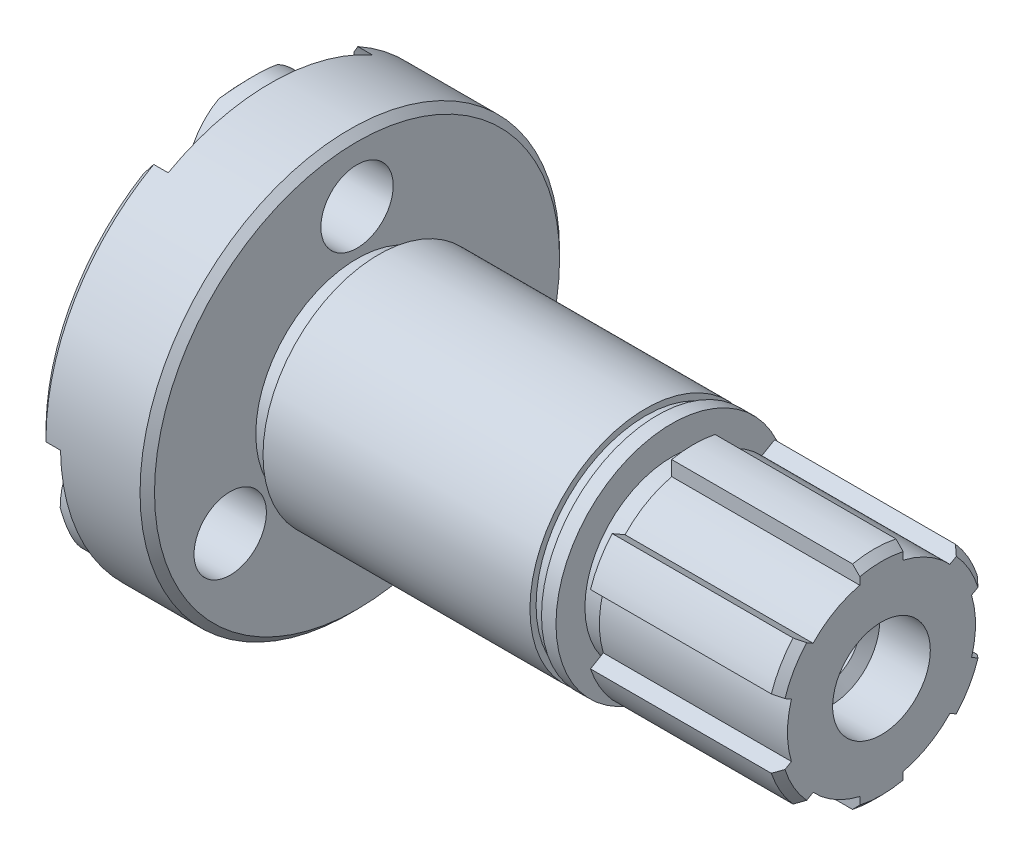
from build123d import *

# Parameters (mm, degrees)
CHANFREIN3_SIZE              = 1
ENL_V_MAT_EXTRU_1_REACH      = 98.635
ESQUISSE2_R                  = 5
ESQUISSE3_R                  = 15
ESQUISSE3_R_2                = 8.5
ENL_V_MAT_EXTRU_2_DEPTH      = 3
R_P_TITION_CIRCULAIRE1_COUNT = 3
ENL_V_MAT_EXTRU_3_REACH      = 98.635
R_P_TITION_CIRCULAIRE2_COUNT = 6
TROU_TARAUD_M12X1_751_D      = 10.2
TROU_TARAUD_M12X1_751_DEPTH  = 35
TROU_TARAUD_M12X1_751_TIP    = 3.064389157
D_GAGEMENT_POUR_M121_D       = 13.5
D_GAGEMENT_POUR_M121_DEPTH   = 7
D_GAGEMENT_POUR_M121_TIP     = 4.055809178


with BuildPart() as part:
    # Esquisse1 → Base-R_volution (revolve)
    with BuildSketch(Plane.XY, mode=Mode.PRIVATE) as base_r_volution_sk:
        Polygon((0, 0), (87.5, 0), (87.5, 15), (61.5, 15), (61.5, 12), (58.5, 12), (58.5, 16), (56.5, 16), (56.5, 15.15), (54.9, 15.15), (54.9, 16), (18, 16), (18, 14), (15, 14), (15, 29), (0, 29), align=None)
    revolve(base_r_volution_sk.sketch.rotate(Axis((0, 0, 0), (1, 0, 0)), 90), axis=Axis((0, 0, 0), (1, 0, 0)))

    # Chanfrein3
    chanfrein3_edges = [part.edges().sort_by_distance(p)[0] for p in [
        (15, 0, -29),
        (0, 0, -29),
        (87.5, 0, -15),
    ]]
    chamfer(chanfrein3_edges, length=CHANFREIN3_SIZE)

    # Esquisse2 → Enl_v. mat.-Extru.1 (cut, up to next)
    with BuildSketch(Plane.ZY, mode=Mode.PRIVATE) as enl_v_mat_extru_1_sk1:
        with Locations((0, 20.25)):
            Circle(ESQUISSE2_R)
    enl_v_mat_extru_1_tool1 = extrude(enl_v_mat_extru_1_sk1.sketch, amount=-ENL_V_MAT_EXTRU_1_REACH, mode=Mode.PRIVATE) & part.part
    enl_v_mat_extru_1 = enl_v_mat_extru_1_tool1.solids().sort_by_distance((0, 20.25, 0))[0]
    add(enl_v_mat_extru_1, mode=Mode.SUBTRACT)

    # Esquisse3 → Enl_v. mat.-Extru.2 (cut)
    with BuildSketch(Plane.ZY):
        with Locations((0, 20.25)):
            Circle(ESQUISSE3_R)
        with Locations((0, 20.25)):
            Circle(ESQUISSE3_R_2, mode=Mode.SUBTRACT)
    enl_v_mat_extru_2 = extrude(amount=-ENL_V_MAT_EXTRU_2_DEPTH, mode=Mode.SUBTRACT)

    # R_p_tition circulaire1: Enl_v. mat.-Extru.1, Enl_v. mat.-Extru.2 ×3 about axis
    r_p_tition_circulaire1_axis = Axis((0, 0, 0), (1, 0, 0))
    add([enl_v_mat_extru_1.rotate(r_p_tition_circulaire1_axis, i * 360 / R_P_TITION_CIRCULAIRE1_COUNT) for i in range(1, R_P_TITION_CIRCULAIRE1_COUNT)], mode=Mode.SUBTRACT)
    add([enl_v_mat_extru_2.rotate(r_p_tition_circulaire1_axis, i * 360 / R_P_TITION_CIRCULAIRE1_COUNT) for i in range(1, R_P_TITION_CIRCULAIRE1_COUNT)], mode=Mode.SUBTRACT)

    # Esquisse4 → Enl_v. mat.-Extru.3 (cut, up to next)
    with BuildSketch(Plane(origin=(87.5, 0, 0), x_dir=(0, 0, -1), z_dir=(1, 0, 0)), mode=Mode.PRIVATE) as enl_v_mat_extru_3_sk1:
        with BuildLine():
            Line((3, 14.696938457), (3, 12.649110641))
            ThreePointArc((3, 12.649110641), (6.5, 11.258330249), (9.45445115, 8.922631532))
            Line((9.45445115, 8.922631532), (11.227922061, 9.94654544))
            ThreePointArc((11.227922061, 9.94654544), (7.5, 12.990381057), (3, 14.696938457))
        make_face()
    enl_v_mat_extru_3_tool1 = extrude(enl_v_mat_extru_3_sk1.sketch, amount=-ENL_V_MAT_EXTRU_3_REACH, mode=Mode.PRIVATE) & part.part
    enl_v_mat_extru_3 = enl_v_mat_extru_3_tool1.solids().sort_by_distance((87.5, 11.96785, -6.909641))[0]
    add(enl_v_mat_extru_3, mode=Mode.SUBTRACT)

    # R_p_tition circulaire2: Enl_v. mat.-Extru.3 ×6 about axis
    r_p_tition_circulaire2_axis = Axis((0, 0, 0), (1, 0, 0))
    for i in range(1, R_P_TITION_CIRCULAIRE2_COUNT):
        add(enl_v_mat_extru_3.rotate(r_p_tition_circulaire2_axis, i * 360 / R_P_TITION_CIRCULAIRE2_COUNT), mode=Mode.SUBTRACT)

    # Trou taraud_ M12x1.751
    with Locations(Plane(origin=(87.5, 0, 0), x_dir=(0, 0, -1), z_dir=(1, 0, 0))):
        with Locations((0, 0)):
            Hole(TROU_TARAUD_M12X1_751_D / 2, depth=TROU_TARAUD_M12X1_751_DEPTH)
            with Locations((0, 0, -(TROU_TARAUD_M12X1_751_DEPTH + TROU_TARAUD_M12X1_751_TIP / 2))):  # 118° drill point
                Cone(0, TROU_TARAUD_M12X1_751_D / 2, TROU_TARAUD_M12X1_751_TIP, mode=Mode.SUBTRACT)

    # D_gagement pour M121
    with Locations(Plane(origin=(87.5, 0, 0), x_dir=(0, 0, -1), z_dir=(1, 0, 0))):
        with Locations((0, 0)):
            Hole(D_GAGEMENT_POUR_M121_D / 2, depth=D_GAGEMENT_POUR_M121_DEPTH)
            with Locations((0, 0, -(D_GAGEMENT_POUR_M121_DEPTH + D_GAGEMENT_POUR_M121_TIP / 2))):  # 118° drill point
                Cone(0, D_GAGEMENT_POUR_M121_D / 2, D_GAGEMENT_POUR_M121_TIP, mode=Mode.SUBTRACT)


solid = part.part
